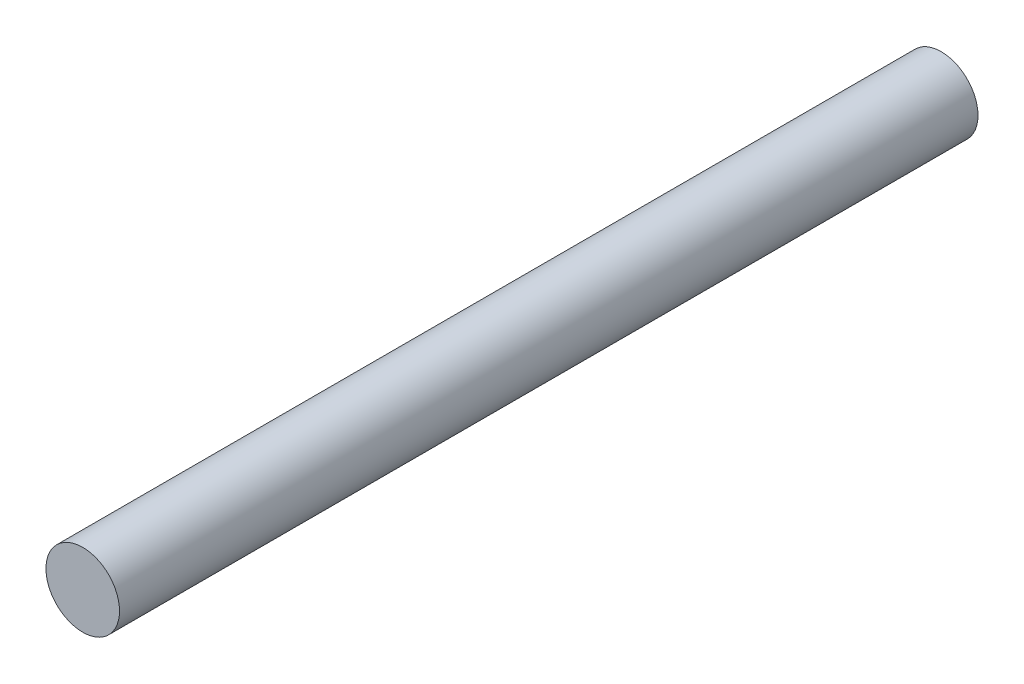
from build123d import *

# Parameters (mm, degrees)
SKETCH1_R           = 1.5
BOSS_EXTRUDE1_DEPTH = 17.5


with BuildPart() as part:
    # Sketch1 → Boss-Extrude1 (new, symmetric)
    with BuildSketch(Plane.XY):
        Circle(SKETCH1_R)
    extrude(amount=BOSS_EXTRUDE1_DEPTH, both=True)


solid = part.part
